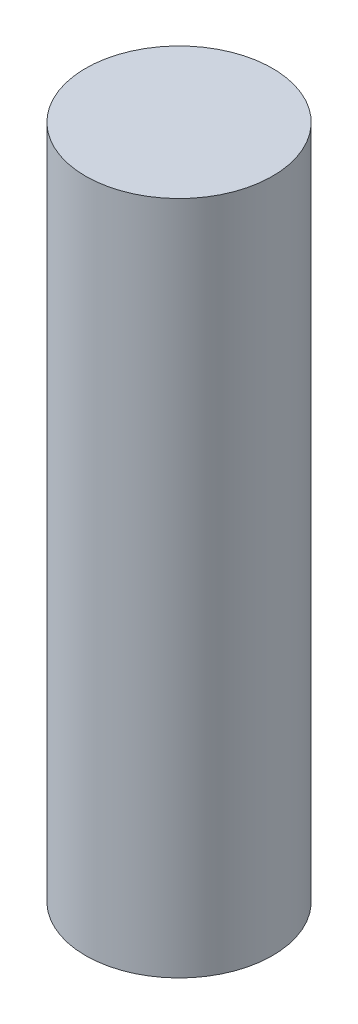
from build123d import *

# Parameters (mm, degrees)
SKETCH1_R           = 9
BOSS_EXTRUDE1_DEPTH = 65


with BuildPart() as part:
    # Sketch1 → Boss-Extrude1 (new body)
    with BuildSketch(Plane(origin=(0, 0, 0), x_dir=(1, 0, 0), z_dir=(0, 1, 0))):
        with Locations(Location((0, 0, 0), (0, 0, 270))):
            Circle(SKETCH1_R)
    extrude(amount=BOSS_EXTRUDE1_DEPTH)


solid = part.part
